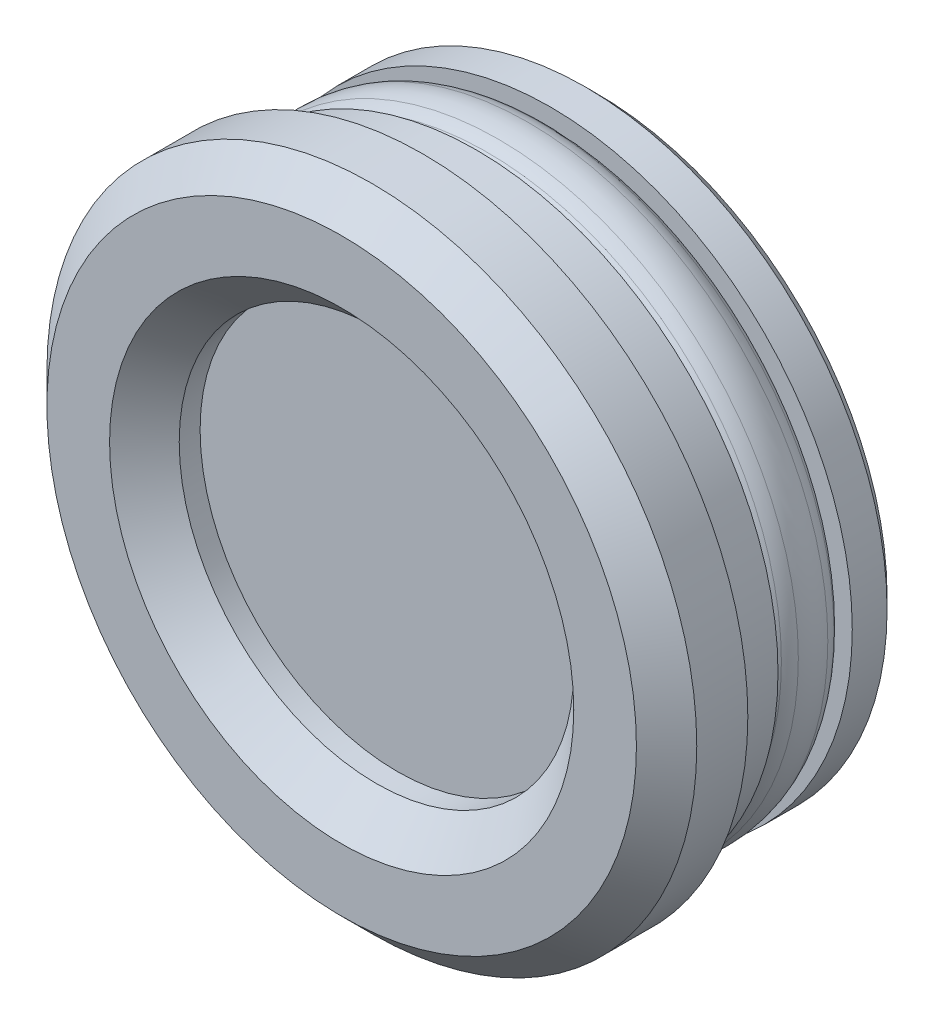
ISO-10303-21;
HEADER;
FILE_DESCRIPTION(('STEP AP214'),'2;1');
FILE_NAME('part.step','',(''),(''),'','','');
FILE_SCHEMA(('AUTOMOTIVE_DESIGN { 1 0 10303 214 1 1 1 1 }'));
ENDSEC;
DATA;
#1=APPLICATION_CONTEXT('core data for automotive mechanical design processes');
#2=APPLICATION_PROTOCOL_DEFINITION('international standard','automotive_design',2000,#1);
#3=PRODUCT_CONTEXT('',#1,'mechanical');
#4=PRODUCT('Part','Part','',(#3));
#5=PRODUCT_RELATED_PRODUCT_CATEGORY('part','',(#4));
#6=PRODUCT_DEFINITION_FORMATION('','',#4);
#7=PRODUCT_DEFINITION_CONTEXT('part definition',#1,'design');
#8=PRODUCT_DEFINITION('design','',#6,#7);
#9=PRODUCT_DEFINITION_SHAPE('','',#8);
#10=(LENGTH_UNIT() NAMED_UNIT(*) SI_UNIT(.MILLI.,.METRE.));
#11=(NAMED_UNIT(*) PLANE_ANGLE_UNIT() SI_UNIT($,.RADIAN.));
#12=(NAMED_UNIT(*) SI_UNIT($,.STERADIAN.) SOLID_ANGLE_UNIT());
#13=UNCERTAINTY_MEASURE_WITH_UNIT(LENGTH_MEASURE(1.E-05),#10,'distance_accuracy_value','');
#14=(GEOMETRIC_REPRESENTATION_CONTEXT(3) GLOBAL_UNCERTAINTY_ASSIGNED_CONTEXT((#13)) GLOBAL_UNIT_ASSIGNED_CONTEXT((#10,
#11,#12)) REPRESENTATION_CONTEXT('',''));
#15=CARTESIAN_POINT('',(0.,0.,0.));
#16=DIRECTION('',(0.,0.,1.));
#17=DIRECTION('',(1.,0.,0.));
#18=AXIS2_PLACEMENT_3D('',#15,#16,#17);
#19=CARTESIAN_POINT('',(0.,0.,3.5));
#20=DIRECTION('',(0.,0.,-1.));
#21=DIRECTION('',(1.,0.,0.));
#22=AXIS2_PLACEMENT_3D('',#19,#20,#21);
#23=CONICAL_SURFACE('',#22,12.6999999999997,0.785398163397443);
#24=CARTESIAN_POINT('',(0.,0.,2.19999999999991));
#25=DIRECTION('',(0.,0.,-1.));
#26=DIRECTION('',(1.,0.,0.));
#27=AXIS2_PLACEMENT_3D('',#24,#25,#26);
#28=CIRCLE('',#27,13.9999999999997);
#29=CARTESIAN_POINT('',(13.9999999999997,0.,2.19999999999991));
#30=VERTEX_POINT('',#29);
#31=EDGE_CURVE('E8',#30,#30,#28,.T.);
#32=ORIENTED_EDGE('',*,*,#31,.F.);
#33=EDGE_LOOP('',(#32));
#34=FACE_BOUND('',#33,.T.);
#35=CARTESIAN_POINT('',(0.,0.,3.5));
#36=DIRECTION('',(0.,0.,-1.));
#37=DIRECTION('',(1.,0.,0.));
#38=AXIS2_PLACEMENT_3D('',#35,#36,#37);
#39=CIRCLE('',#38,12.6999999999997);
#40=CARTESIAN_POINT('',(12.6999999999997,0.,3.5));
#41=VERTEX_POINT('',#40);
#42=EDGE_CURVE('E70',#41,#41,#39,.T.);
#43=ORIENTED_EDGE('',*,*,#42,.T.);
#44=EDGE_LOOP('',(#43));
#45=FACE_BOUND('',#44,.T.);
#46=ADVANCED_FACE('F12',(#34,#45),#23,.T.);
#47=CARTESIAN_POINT('',(0.,0.,-14.0471742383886));
#48=DIRECTION('',(0.,0.,-1.));
#49=DIRECTION('',(1.,0.,0.));
#50=AXIS2_PLACEMENT_3D('',#47,#48,#49);
#51=CYLINDRICAL_SURFACE('',#50,13.9999999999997);
#52=CARTESIAN_POINT('',(0.,0.,0.));
#53=DIRECTION('',(0.,0.,-1.));
#54=DIRECTION('',(1.,0.,0.));
#55=AXIS2_PLACEMENT_3D('',#52,#53,#54);
#56=CIRCLE('',#55,13.9999999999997);
#57=CARTESIAN_POINT('',(13.9999999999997,0.,0.));
#58=VERTEX_POINT('',#57);
#59=EDGE_CURVE('E18',#58,#58,#56,.T.);
#60=ORIENTED_EDGE('',*,*,#59,.F.);
#61=EDGE_LOOP('',(#60));
#62=FACE_BOUND('',#61,.T.);
#63=ORIENTED_EDGE('',*,*,#31,.T.);
#64=EDGE_LOOP('',(#63));
#65=FACE_BOUND('',#64,.T.);
#66=ADVANCED_FACE('F100',(#62,#65),#51,.T.);
#67=CARTESIAN_POINT('',(0.,-13.,0.));
#68=DIRECTION('',(0.,0.,-1.));
#69=DIRECTION('',(1.,0.,0.));
#70=AXIS2_PLACEMENT_3D('',#67,#68,#69);
#71=PLANE('',#70);
#72=ORIENTED_EDGE('',*,*,#59,.T.);
#73=EDGE_LOOP('',(#72));
#74=FACE_BOUND('',#73,.T.);
#75=CARTESIAN_POINT('',(0.,0.,0.));
#76=DIRECTION('',(0.,0.,-1.));
#77=DIRECTION('',(1.,0.,0.));
#78=AXIS2_PLACEMENT_3D('',#75,#76,#77);
#79=CIRCLE('',#78,13.);
#80=CARTESIAN_POINT('',(13.,0.,0.));
#81=VERTEX_POINT('',#80);
#82=EDGE_CURVE('E22',#81,#81,#79,.T.);
#83=ORIENTED_EDGE('',*,*,#82,.F.);
#84=EDGE_LOOP('',(#83));
#85=FACE_BOUND('',#84,.T.);
#86=ADVANCED_FACE('F107',(#74,#85),#71,.T.);
#87=CARTESIAN_POINT('',(0.,0.,-14.0471742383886));
#88=DIRECTION('',(0.,0.,-1.));
#89=DIRECTION('',(1.,0.,0.));
#90=AXIS2_PLACEMENT_3D('',#87,#88,#89);
#91=CYLINDRICAL_SURFACE('',#90,13.);
#92=ORIENTED_EDGE('',*,*,#82,.T.);
#93=EDGE_LOOP('',(#92));
#94=FACE_BOUND('',#93,.T.);
#95=CARTESIAN_POINT('',(0.,0.,-2.30000000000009));
#96=DIRECTION('',(0.,0.,-1.));
#97=DIRECTION('',(1.,0.,0.));
#98=AXIS2_PLACEMENT_3D('',#95,#96,#97);
#99=CIRCLE('',#98,13.);
#100=CARTESIAN_POINT('',(13.,0.,-2.30000000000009));
#101=VERTEX_POINT('',#100);
#102=EDGE_CURVE('E26',#101,#101,#99,.T.);
#103=ORIENTED_EDGE('',*,*,#102,.F.);
#104=EDGE_LOOP('',(#103));
#105=FACE_BOUND('',#104,.T.);
#106=ADVANCED_FACE('F113',(#94,#105),#91,.T.);
#107=CARTESIAN_POINT('',(0.,-11.9,-2.300000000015));
#108=DIRECTION('',(0.,0.,-1.));
#109=DIRECTION('',(1.,0.,0.));
#110=AXIS2_PLACEMENT_3D('',#107,#108,#109);
#111=PLANE('',#110);
#112=ORIENTED_EDGE('',*,*,#102,.T.);
#113=EDGE_LOOP('',(#112));
#114=FACE_BOUND('',#113,.T.);
#115=CARTESIAN_POINT('',(0.,0.,-2.30000000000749));
#116=DIRECTION('',(0.,0.,-1.));
#117=DIRECTION('',(1.,0.,0.));
#118=AXIS2_PLACEMENT_3D('',#115,#116,#117);
#119=CIRCLE('',#118,11.9);
#120=CARTESIAN_POINT('',(11.9,0.,-2.30000000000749));
#121=VERTEX_POINT('',#120);
#122=EDGE_CURVE('E31',#121,#121,#119,.T.);
#123=ORIENTED_EDGE('',*,*,#122,.F.);
#124=EDGE_LOOP('',(#123));
#125=FACE_BOUND('',#124,.T.);
#126=ADVANCED_FACE('F118',(#114,#125),#111,.T.);
#127=CARTESIAN_POINT('',(0.,0.,-3.0702729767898));
#128=DIRECTION('',(0.,0.,-1.));
#129=DIRECTION('',(1.,0.,0.));
#130=AXIS2_PLACEMENT_3D('',#127,#128,#129);
#131=TOROIDAL_SURFACE('',#130,11.9,0.770272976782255);
#132=CARTESIAN_POINT('',(0.,0.,-2.41049595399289));
#133=DIRECTION('',(0.,0.,-1.));
#134=DIRECTION('',(1.,0.,0.));
#135=AXIS2_PLACEMENT_3D('',#132,#133,#134);
#136=CIRCLE('',#135,12.2975106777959);
#137=CARTESIAN_POINT('',(12.2975106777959,0.,-2.41049595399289));
#138=VERTEX_POINT('',#137);
#139=EDGE_CURVE('E34',#138,#138,#136,.T.);
#140=ORIENTED_EDGE('',*,*,#139,.F.);
#141=EDGE_LOOP('',(#140));
#142=FACE_BOUND('',#141,.T.);
#143=ORIENTED_EDGE('',*,*,#122,.T.);
#144=EDGE_LOOP('',(#143));
#145=FACE_BOUND('',#144,.T.);
#146=ADVANCED_FACE('F122',(#142,#145),#131,.T.);
#147=CARTESIAN_POINT('',(0.,0.,-3.46820925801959));
#148=DIRECTION('',(0.,0.,-1.));
#149=DIRECTION('',(1.,0.,0.));
#150=AXIS2_PLACEMENT_3D('',#147,#148,#149);
#151=TOROIDAL_SURFACE('',#150,11.6602463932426,1.23485351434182);
#152=CARTESIAN_POINT('',(0.,0.,-2.76862915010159));
#153=DIRECTION('',(0.,0.,-1.));
#154=DIRECTION('',(1.,0.,0.));
#155=AXIS2_PLACEMENT_3D('',#152,#153,#154);
#156=CIRCLE('',#155,12.6778174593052);
#157=CARTESIAN_POINT('',(12.6778174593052,0.,-2.76862915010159));
#158=VERTEX_POINT('',#157);
#159=EDGE_CURVE('E37',#158,#158,#156,.T.);
#160=ORIENTED_EDGE('',*,*,#159,.F.);
#161=EDGE_LOOP('',(#160));
#162=FACE_BOUND('',#161,.T.);
#163=ORIENTED_EDGE('',*,*,#139,.T.);
#164=EDGE_LOOP('',(#163));
#165=FACE_BOUND('',#164,.T.);
#166=ADVANCED_FACE('F126',(#162,#165),#151,.T.);
#167=CARTESIAN_POINT('',(0.,0.,-3.72916216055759));
#168=DIRECTION('',(0.,0.,-1.));
#169=DIRECTION('',(1.,0.,0.));
#170=AXIS2_PLACEMENT_3D('',#167,#168,#169);
#171=TOROIDAL_SURFACE('',#170,11.2806785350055,1.69547068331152);
#172=CARTESIAN_POINT('',(0.,0.,-3.2648015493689));
#173=DIRECTION('',(0.,0.,-1.));
#174=DIRECTION('',(1.,0.,0.));
#175=AXIS2_PLACEMENT_3D('',#172,#173,#174);
#176=CIRCLE('',#175,12.9113195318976);
#177=CARTESIAN_POINT('',(12.9113195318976,0.,-3.2648015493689));
#178=VERTEX_POINT('',#177);
#179=EDGE_CURVE('E40',#178,#178,#176,.T.);
#180=ORIENTED_EDGE('',*,*,#179,.F.);
#181=EDGE_LOOP('',(#180));
#182=FACE_BOUND('',#181,.T.);
#183=ORIENTED_EDGE('',*,*,#159,.T.);
#184=EDGE_LOOP('',(#183));
#185=FACE_BOUND('',#184,.T.);
#186=ADVANCED_FACE('F130',(#182,#185),#171,.T.);
#187=CARTESIAN_POINT('',(0.,0.,-3.9));
#188=DIRECTION('',(0.,0.,-1.));
#189=DIRECTION('',(1.,0.,0.));
#190=AXIS2_PLACEMENT_3D('',#187,#188,#189);
#191=TOROIDAL_SURFACE('',#190,10.6807672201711,2.31923277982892);
#192=CARTESIAN_POINT('',(0.,0.,-4.5351984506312));
#193=DIRECTION('',(0.,0.,-1.));
#194=DIRECTION('',(1.,0.,0.));
#195=AXIS2_PLACEMENT_3D('',#192,#193,#194);
#196=CIRCLE('',#195,12.9113195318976);
#197=CARTESIAN_POINT('',(12.9113195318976,0.,-4.5351984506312));
#198=VERTEX_POINT('',#197);
#199=EDGE_CURVE('E43',#198,#198,#196,.T.);
#200=ORIENTED_EDGE('',*,*,#199,.F.);
#201=EDGE_LOOP('',(#200));
#202=FACE_BOUND('',#201,.T.);
#203=ORIENTED_EDGE('',*,*,#179,.T.);
#204=EDGE_LOOP('',(#203));
#205=FACE_BOUND('',#204,.T.);
#206=ADVANCED_FACE('F134',(#202,#205),#191,.T.);
#207=CARTESIAN_POINT('',(0.,0.,-4.0708378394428));
#208=DIRECTION('',(0.,0.,-1.));
#209=DIRECTION('',(1.,0.,0.));
#210=AXIS2_PLACEMENT_3D('',#207,#208,#209);
#211=TOROIDAL_SURFACE('',#210,11.280678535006,1.69547068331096);
#212=CARTESIAN_POINT('',(0.,0.,-5.03137084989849));
#213=DIRECTION('',(0.,0.,-1.));
#214=DIRECTION('',(1.,0.,0.));
#215=AXIS2_PLACEMENT_3D('',#212,#213,#214);
#216=CIRCLE('',#215,12.6778174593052);
#217=CARTESIAN_POINT('',(12.6778174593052,0.,-5.03137084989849));
#218=VERTEX_POINT('',#217);
#219=EDGE_CURVE('E46',#218,#218,#216,.T.);
#220=ORIENTED_EDGE('',*,*,#219,.F.);
#221=EDGE_LOOP('',(#220));
#222=FACE_BOUND('',#221,.T.);
#223=ORIENTED_EDGE('',*,*,#199,.T.);
#224=EDGE_LOOP('',(#223));
#225=FACE_BOUND('',#224,.T.);
#226=ADVANCED_FACE('F138',(#222,#225),#211,.T.);
#227=CARTESIAN_POINT('',(0.,0.,-4.33179074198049));
#228=DIRECTION('',(0.,0.,-1.));
#229=DIRECTION('',(1.,0.,0.));
#230=AXIS2_PLACEMENT_3D('',#227,#228,#229);
#231=TOROIDAL_SURFACE('',#230,11.6602463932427,1.23485351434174);
#232=CARTESIAN_POINT('',(0.,0.,-5.3895040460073));
#233=DIRECTION('',(0.,0.,-1.));
#234=DIRECTION('',(1.,0.,0.));
#235=AXIS2_PLACEMENT_3D('',#232,#233,#234);
#236=CIRCLE('',#235,12.2975106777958);
#237=CARTESIAN_POINT('',(12.2975106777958,0.,-5.3895040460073));
#238=VERTEX_POINT('',#237);
#239=EDGE_CURVE('E49',#238,#238,#236,.T.);
#240=ORIENTED_EDGE('',*,*,#239,.F.);
#241=EDGE_LOOP('',(#240));
#242=FACE_BOUND('',#241,.T.);
#243=ORIENTED_EDGE('',*,*,#219,.T.);
#244=EDGE_LOOP('',(#243));
#245=FACE_BOUND('',#244,.T.);
#246=ADVANCED_FACE('F142',(#242,#245),#231,.T.);
#247=CARTESIAN_POINT('',(0.,0.,-4.72972702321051));
#248=DIRECTION('',(0.,0.,-1.));
#249=DIRECTION('',(1.,0.,0.));
#250=AXIS2_PLACEMENT_3D('',#247,#248,#249);
#251=TOROIDAL_SURFACE('',#250,11.9,0.770272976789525);
#252=CARTESIAN_POINT('',(0.,0.,-5.5));
#253=DIRECTION('',(0.,0.,-1.));
#254=DIRECTION('',(1.,0.,0.));
#255=AXIS2_PLACEMENT_3D('',#252,#253,#254);
#256=CIRCLE('',#255,11.9);
#257=CARTESIAN_POINT('',(11.9,0.,-5.5));
#258=VERTEX_POINT('',#257);
#259=EDGE_CURVE('E52',#258,#258,#256,.T.);
#260=ORIENTED_EDGE('',*,*,#259,.F.);
#261=EDGE_LOOP('',(#260));
#262=FACE_BOUND('',#261,.T.);
#263=ORIENTED_EDGE('',*,*,#239,.T.);
#264=EDGE_LOOP('',(#263));
#265=FACE_BOUND('',#264,.T.);
#266=ADVANCED_FACE('F146',(#262,#265),#251,.T.);
#267=CARTESIAN_POINT('',(0.,-11.9,-5.5));
#268=DIRECTION('',(0.,0.,-1.));
#269=DIRECTION('',(1.,0.,0.));
#270=AXIS2_PLACEMENT_3D('',#267,#268,#269);
#271=PLANE('',#270);
#272=CARTESIAN_POINT('',(0.,0.,-5.5));
#273=DIRECTION('',(0.,0.,-1.));
#274=DIRECTION('',(1.,0.,0.));
#275=AXIS2_PLACEMENT_3D('',#272,#273,#274);
#276=CIRCLE('',#275,13.);
#277=CARTESIAN_POINT('',(13.,0.,-5.5));
#278=VERTEX_POINT('',#277);
#279=EDGE_CURVE('E55',#278,#278,#276,.T.);
#280=ORIENTED_EDGE('',*,*,#279,.F.);
#281=EDGE_LOOP('',(#280));
#282=FACE_BOUND('',#281,.T.);
#283=ORIENTED_EDGE('',*,*,#259,.T.);
#284=EDGE_LOOP('',(#283));
#285=FACE_BOUND('',#284,.T.);
#286=ADVANCED_FACE('F150',(#282,#285),#271,.F.);
#287=CARTESIAN_POINT('',(0.,0.,-14.0471742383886));
#288=DIRECTION('',(0.,0.,-1.));
#289=DIRECTION('',(1.,0.,0.));
#290=AXIS2_PLACEMENT_3D('',#287,#288,#289);
#291=CYLINDRICAL_SURFACE('',#290,13.);
#292=ORIENTED_EDGE('',*,*,#279,.T.);
#293=EDGE_LOOP('',(#292));
#294=FACE_BOUND('',#293,.T.);
#295=CARTESIAN_POINT('',(0.,0.,-7.));
#296=DIRECTION('',(0.,0.,-1.));
#297=DIRECTION('',(1.,0.,0.));
#298=AXIS2_PLACEMENT_3D('',#295,#296,#297);
#299=CIRCLE('',#298,13.);
#300=CARTESIAN_POINT('',(13.,0.,-7.));
#301=VERTEX_POINT('',#300);
#302=EDGE_CURVE('E58',#301,#301,#299,.T.);
#303=ORIENTED_EDGE('',*,*,#302,.F.);
#304=EDGE_LOOP('',(#303));
#305=FACE_BOUND('',#304,.T.);
#306=ADVANCED_FACE('F154',(#294,#305),#291,.T.);
#307=CARTESIAN_POINT('',(0.,0.,-7.5));
#308=DIRECTION('',(0.,0.,1.));
#309=DIRECTION('',(-1.,0.,0.));
#310=AXIS2_PLACEMENT_3D('',#307,#308,#309);
#311=CONICAL_SURFACE('',#310,12.5,0.785398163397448);
#312=ORIENTED_EDGE('',*,*,#302,.T.);
#313=EDGE_LOOP('',(#312));
#314=FACE_BOUND('',#313,.T.);
#315=CARTESIAN_POINT('',(0.,0.,-7.5));
#316=DIRECTION('',(0.,0.,-1.));
#317=DIRECTION('',(1.,0.,0.));
#318=AXIS2_PLACEMENT_3D('',#315,#316,#317);
#319=CIRCLE('',#318,12.5);
#320=CARTESIAN_POINT('',(12.5,0.,-7.5));
#321=VERTEX_POINT('',#320);
#322=EDGE_CURVE('E61',#321,#321,#319,.T.);
#323=ORIENTED_EDGE('',*,*,#322,.F.);
#324=EDGE_LOOP('',(#323));
#325=FACE_BOUND('',#324,.T.);
#326=ADVANCED_FACE('F158',(#314,#325),#311,.T.);
#327=CARTESIAN_POINT('',(0.,-11.25,-7.5));
#328=DIRECTION('',(0.,0.,-1.));
#329=DIRECTION('',(1.,0.,0.));
#330=AXIS2_PLACEMENT_3D('',#327,#328,#329);
#331=PLANE('',#330);
#332=ORIENTED_EDGE('',*,*,#322,.T.);
#333=EDGE_LOOP('',(#332));
#334=FACE_BOUND('',#333,.T.);
#335=CARTESIAN_POINT('',(0.,0.,-7.5));
#336=DIRECTION('',(0.,0.,-1.));
#337=DIRECTION('',(1.,0.,0.));
#338=AXIS2_PLACEMENT_3D('',#335,#336,#337);
#339=CIRCLE('',#338,11.25);
#340=CARTESIAN_POINT('',(11.25,0.,-7.5));
#341=VERTEX_POINT('',#340);
#342=EDGE_CURVE('E64',#341,#341,#339,.T.);
#343=ORIENTED_EDGE('',*,*,#342,.F.);
#344=EDGE_LOOP('',(#343));
#345=FACE_BOUND('',#344,.T.);
#346=ADVANCED_FACE('F162',(#334,#345),#331,.T.);
#347=CARTESIAN_POINT('',(0.,0.,-14.0471742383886));
#348=DIRECTION('',(0.,0.,-1.));
#349=DIRECTION('',(1.,0.,0.));
#350=AXIS2_PLACEMENT_3D('',#347,#348,#349);
#351=CYLINDRICAL_SURFACE('',#350,11.25);
#352=ORIENTED_EDGE('',*,*,#342,.T.);
#353=EDGE_LOOP('',(#352));
#354=FACE_BOUND('',#353,.T.);
#355=CARTESIAN_POINT('',(0.,0.,-8.));
#356=DIRECTION('',(0.,0.,-1.));
#357=DIRECTION('',(1.,0.,0.));
#358=AXIS2_PLACEMENT_3D('',#355,#356,#357);
#359=CIRCLE('',#358,11.25);
#360=CARTESIAN_POINT('',(11.25,0.,-8.));
#361=VERTEX_POINT('',#360);
#362=EDGE_CURVE('E67',#361,#361,#359,.T.);
#363=ORIENTED_EDGE('',*,*,#362,.F.);
#364=EDGE_LOOP('',(#363));
#365=FACE_BOUND('',#364,.T.);
#366=ADVANCED_FACE('F166',(#354,#365),#351,.T.);
#367=CARTESIAN_POINT('',(0.,0.,-8.00000000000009));
#368=DIRECTION('',(0.,0.,-1.));
#369=DIRECTION('',(1.,0.,0.));
#370=AXIS2_PLACEMENT_3D('',#367,#368,#369);
#371=PLANE('',#370);
#372=ORIENTED_EDGE('',*,*,#362,.T.);
#373=EDGE_LOOP('',(#372));
#374=FACE_BOUND('',#373,.T.);
#375=ADVANCED_FACE('F95',(#374),#371,.T.);
#376=CARTESIAN_POINT('',(0.,0.,3.5));
#377=DIRECTION('',(0.,0.,-1.));
#378=DIRECTION('',(1.,0.,0.));
#379=AXIS2_PLACEMENT_3D('',#376,#377,#378);
#380=PLANE('',#379);
#381=CARTESIAN_POINT('',(0.,0.,3.5));
#382=DIRECTION('',(0.,0.,1.));
#383=DIRECTION('',(-1.,0.,0.));
#384=AXIS2_PLACEMENT_3D('',#381,#382,#383);
#385=CIRCLE('',#384,10.);
#386=CARTESIAN_POINT('',(-10.,0.,3.5));
#387=VERTEX_POINT('',#386);
#388=EDGE_CURVE('E76',#387,#387,#385,.T.);
#389=ORIENTED_EDGE('',*,*,#388,.F.);
#390=EDGE_LOOP('',(#389));
#391=FACE_BOUND('',#390,.T.);
#392=ORIENTED_EDGE('',*,*,#42,.F.);
#393=EDGE_LOOP('',(#392));
#394=FACE_BOUND('',#393,.T.);
#395=ADVANCED_FACE('F92',(#391,#394),#380,.F.);
#396=CARTESIAN_POINT('',(0.,0.,8.5054811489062));
#397=DIRECTION('',(0.,0.,1.));
#398=DIRECTION('',(-1.,0.,0.));
#399=AXIS2_PLACEMENT_3D('',#396,#397,#398);
#400=CYLINDRICAL_SURFACE('',#399,8.5);
#401=CARTESIAN_POINT('',(0.,0.,1.1));
#402=DIRECTION('',(0.,0.,1.));
#403=DIRECTION('',(-1.,0.,0.));
#404=AXIS2_PLACEMENT_3D('',#401,#402,#403);
#405=CIRCLE('',#404,8.5);
#406=CARTESIAN_POINT('',(-8.5,0.,1.1));
#407=VERTEX_POINT('',#406);
#408=EDGE_CURVE('E73',#407,#407,#405,.T.);
#409=ORIENTED_EDGE('',*,*,#408,.F.);
#410=EDGE_LOOP('',(#409));
#411=FACE_BOUND('',#410,.T.);
#412=CARTESIAN_POINT('',(0.,0.,2.));
#413=DIRECTION('',(0.,0.,1.));
#414=DIRECTION('',(-1.,0.,0.));
#415=AXIS2_PLACEMENT_3D('',#412,#413,#414);
#416=CIRCLE('',#415,8.5);
#417=CARTESIAN_POINT('',(-8.5,0.,2.));
#418=VERTEX_POINT('',#417);
#419=EDGE_CURVE('E79',#418,#418,#416,.T.);
#420=ORIENTED_EDGE('',*,*,#419,.T.);
#421=EDGE_LOOP('',(#420));
#422=FACE_BOUND('',#421,.T.);
#423=ADVANCED_FACE('F83',(#411,#422),#400,.F.);
#424=CARTESIAN_POINT('',(0.,-8.5,1.1));
#425=DIRECTION('',(0.,0.,-1.));
#426=DIRECTION('',(1.,0.,0.));
#427=AXIS2_PLACEMENT_3D('',#424,#425,#426);
#428=PLANE('',#427);
#429=ORIENTED_EDGE('',*,*,#408,.T.);
#430=EDGE_LOOP('',(#429));
#431=FACE_BOUND('',#430,.T.);
#432=ADVANCED_FACE('F88',(#431),#428,.F.);
#433=CARTESIAN_POINT('',(0.,0.,3.5));
#434=DIRECTION('',(0.,0.,1.));
#435=DIRECTION('',(-1.,0.,0.));
#436=AXIS2_PLACEMENT_3D('',#433,#434,#435);
#437=CONICAL_SURFACE('',#436,10.,0.785398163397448);
#438=ORIENTED_EDGE('',*,*,#419,.F.);
#439=EDGE_LOOP('',(#438));
#440=FACE_BOUND('',#439,.T.);
#441=ORIENTED_EDGE('',*,*,#388,.T.);
#442=EDGE_LOOP('',(#441));
#443=FACE_BOUND('',#442,.T.);
#444=ADVANCED_FACE('F85',(#440,#443),#437,.F.);
#445=CLOSED_SHELL('',(#46,#66,#86,#106,#126,#146,#166,#186,#206,#226,#246,#266,#286,#306,#326,
#346,#366,#375,#395,#423,#432,#444));
#446=MANIFOLD_SOLID_BREP('B1',#445);
#447=ADVANCED_BREP_SHAPE_REPRESENTATION('',(#18,#446),#14);
#448=SHAPE_DEFINITION_REPRESENTATION(#9,#447);
ENDSEC;
END-ISO-10303-21;
